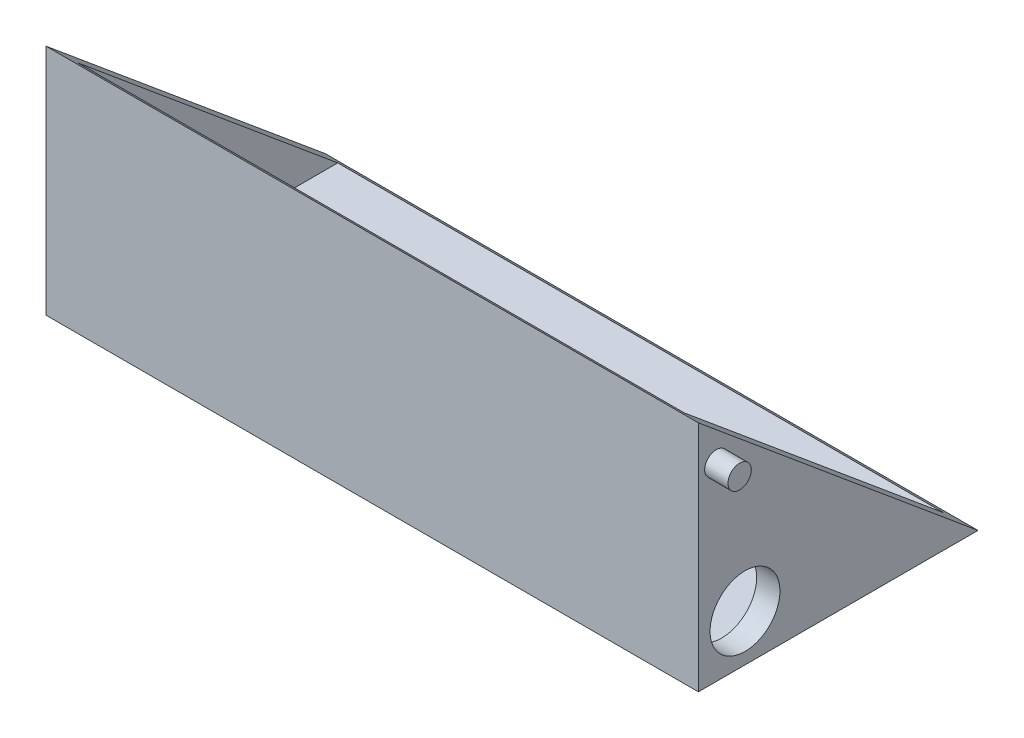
ISO-10303-21;
HEADER;
FILE_DESCRIPTION(('STEP AP214'),'2;1');
FILE_NAME('part.step','',(''),(''),'','','');
FILE_SCHEMA(('AUTOMOTIVE_DESIGN { 1 0 10303 214 1 1 1 1 }'));
ENDSEC;
DATA;
#1=APPLICATION_CONTEXT('core data for automotive mechanical design processes');
#2=APPLICATION_PROTOCOL_DEFINITION('international standard','automotive_design',2000,#1);
#3=PRODUCT_CONTEXT('',#1,'mechanical');
#4=PRODUCT('Part','Part','',(#3));
#5=PRODUCT_RELATED_PRODUCT_CATEGORY('part','',(#4));
#6=PRODUCT_DEFINITION_FORMATION('','',#4);
#7=PRODUCT_DEFINITION_CONTEXT('part definition',#1,'design');
#8=PRODUCT_DEFINITION('design','',#6,#7);
#9=PRODUCT_DEFINITION_SHAPE('','',#8);
#10=(LENGTH_UNIT() NAMED_UNIT(*) SI_UNIT(.MILLI.,.METRE.));
#11=(NAMED_UNIT(*) PLANE_ANGLE_UNIT() SI_UNIT($,.RADIAN.));
#12=(NAMED_UNIT(*) SI_UNIT($,.STERADIAN.) SOLID_ANGLE_UNIT());
#13=UNCERTAINTY_MEASURE_WITH_UNIT(LENGTH_MEASURE(1.E-05),#10,'distance_accuracy_value','');
#14=(GEOMETRIC_REPRESENTATION_CONTEXT(3) GLOBAL_UNCERTAINTY_ASSIGNED_CONTEXT((#13)) GLOBAL_UNIT_ASSIGNED_CONTEXT((#10,
#11,#12)) REPRESENTATION_CONTEXT('',''));
#15=CARTESIAN_POINT('',(0.,0.,0.));
#16=DIRECTION('',(0.,0.,1.));
#17=DIRECTION('',(1.,0.,0.));
#18=AXIS2_PLACEMENT_3D('',#15,#16,#17);
#19=CARTESIAN_POINT('',(-177.8,0.,-76.2));
#20=DIRECTION('',(0.,0.768221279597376,-0.64018439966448));
#21=DIRECTION('',(0.,0.64018439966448,0.768221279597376));
#22=AXIS2_PLACEMENT_3D('',#19,#20,#21);
#23=PLANE('',#22);
#24=DIRECTION('',(0.,0.64018439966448,0.768221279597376));
#25=VECTOR('',#24,1.);
#26=CARTESIAN_POINT('',(0.,0.,-76.2));
#27=LINE('',#26,#25);
#28=CARTESIAN_POINT('',(0.,0.,-76.2));
#29=VERTEX_POINT('',#28);
#30=CARTESIAN_POINT('',(0.,63.5,0.));
#31=VERTEX_POINT('',#30);
#32=EDGE_CURVE('E114',#29,#31,#27,.T.);
#33=ORIENTED_EDGE('',*,*,#32,.F.);
#34=DIRECTION('',(1.,0.,0.));
#35=VECTOR('',#34,1.);
#36=CARTESIAN_POINT('',(-177.8,0.,-76.2));
#37=LINE('',#36,#35);
#38=CARTESIAN_POINT('',(-177.8,0.,-76.2));
#39=VERTEX_POINT('',#38);
#40=EDGE_CURVE('E129',#39,#29,#37,.T.);
#41=ORIENTED_EDGE('',*,*,#40,.F.);
#42=DIRECTION('',(0.,0.64018439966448,0.768221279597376));
#43=VECTOR('',#42,1.);
#44=CARTESIAN_POINT('',(-177.8,0.,-76.2));
#45=LINE('',#44,#43);
#46=CARTESIAN_POINT('',(-177.8,63.5,0.));
#47=VERTEX_POINT('',#46);
#48=EDGE_CURVE('E117',#39,#47,#45,.T.);
#49=ORIENTED_EDGE('',*,*,#48,.T.);
#50=DIRECTION('',(1.,0.,0.));
#51=VECTOR('',#50,1.);
#52=CARTESIAN_POINT('',(-177.8,63.5,0.));
#53=LINE('',#52,#51);
#54=EDGE_CURVE('E58',#47,#31,#53,.T.);
#55=ORIENTED_EDGE('',*,*,#54,.T.);
#56=EDGE_LOOP('',(#33,#41,#49,#55));
#57=FACE_BOUND('',#56,.T.);
#58=DIRECTION('',(0.,0.64018439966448,0.768221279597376));
#59=VECTOR('',#58,1.);
#60=CARTESIAN_POINT('',(-6.34999999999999,0.,-76.2));
#61=LINE('',#60,#59);
#62=CARTESIAN_POINT('',(-6.34999999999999,2.54000000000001,-73.152));
#63=VERTEX_POINT('',#62);
#64=CARTESIAN_POINT('',(-6.35,61.3833333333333,-2.53999999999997));
#65=VERTEX_POINT('',#64);
#66=EDGE_CURVE('E94',#63,#65,#61,.T.);
#67=ORIENTED_EDGE('',*,*,#66,.T.);
#68=DIRECTION('',(-1.,0.,0.));
#69=VECTOR('',#68,1.);
#70=CARTESIAN_POINT('',(-177.8,61.3833333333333,-2.54));
#71=LINE('',#70,#69);
#72=CARTESIAN_POINT('',(-171.45,61.3833333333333,-2.54));
#73=VERTEX_POINT('',#72);
#74=EDGE_CURVE('E11',#65,#73,#71,.T.);
#75=ORIENTED_EDGE('',*,*,#74,.T.);
#76=DIRECTION('',(0.,-0.64018439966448,-0.768221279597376));
#77=VECTOR('',#76,1.);
#78=CARTESIAN_POINT('',(-171.45,0.,-76.2));
#79=LINE('',#78,#77);
#80=CARTESIAN_POINT('',(-171.45,2.54000000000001,-73.152));
#81=VERTEX_POINT('',#80);
#82=EDGE_CURVE('E42',#73,#81,#79,.T.);
#83=ORIENTED_EDGE('',*,*,#82,.T.);
#84=DIRECTION('',(-1.,0.,0.));
#85=VECTOR('',#84,1.);
#86=CARTESIAN_POINT('',(-177.8,2.54000000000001,-73.152));
#87=LINE('',#86,#85);
#88=EDGE_CURVE('E128',#63,#81,#87,.T.);
#89=ORIENTED_EDGE('',*,*,#88,.F.);
#90=EDGE_LOOP('',(#67,#75,#83,#89));
#91=FACE_BOUND('',#90,.T.);
#92=ADVANCED_FACE('F33',(#57,#91),#23,.T.);
#93=CARTESIAN_POINT('',(-177.8,0.,0.));
#94=DIRECTION('',(0.,-1.,0.));
#95=DIRECTION('',(0.,0.,-1.));
#96=AXIS2_PLACEMENT_3D('',#93,#94,#95);
#97=PLANE('',#96);
#98=DIRECTION('',(0.,0.,-1.));
#99=VECTOR('',#98,1.);
#100=CARTESIAN_POINT('',(0.,0.,0.));
#101=LINE('',#100,#99);
#102=CARTESIAN_POINT('',(0.,0.,0.));
#103=VERTEX_POINT('',#102);
#104=EDGE_CURVE('E122',#103,#29,#101,.T.);
#105=ORIENTED_EDGE('',*,*,#104,.F.);
#106=DIRECTION('',(1.,0.,0.));
#107=VECTOR('',#106,1.);
#108=CARTESIAN_POINT('',(-177.8,0.,0.));
#109=LINE('',#108,#107);
#110=CARTESIAN_POINT('',(-177.8,0.,0.));
#111=VERTEX_POINT('',#110);
#112=EDGE_CURVE('E120',#111,#103,#109,.T.);
#113=ORIENTED_EDGE('',*,*,#112,.F.);
#114=DIRECTION('',(0.,0.,-1.));
#115=VECTOR('',#114,1.);
#116=CARTESIAN_POINT('',(-177.8,0.,0.));
#117=LINE('',#116,#115);
#118=EDGE_CURVE('E113',#111,#39,#117,.T.);
#119=ORIENTED_EDGE('',*,*,#118,.T.);
#120=ORIENTED_EDGE('',*,*,#40,.T.);
#121=EDGE_LOOP('',(#105,#113,#119,#120));
#122=FACE_BOUND('',#121,.T.);
#123=ADVANCED_FACE('F178',(#122),#97,.T.);
#124=CARTESIAN_POINT('',(-177.8,22.975670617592,0.));
#125=DIRECTION('',(0.,0.,1.));
#126=DIRECTION('',(1.,0.,0.));
#127=AXIS2_PLACEMENT_3D('',#124,#125,#126);
#128=PLANE('',#127);
#129=DIRECTION('',(0.,-1.,0.));
#130=VECTOR('',#129,1.);
#131=CARTESIAN_POINT('',(0.,22.975670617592,0.));
#132=LINE('',#131,#130);
#133=EDGE_CURVE('E73',#31,#103,#132,.T.);
#134=ORIENTED_EDGE('',*,*,#133,.F.);
#135=ORIENTED_EDGE('',*,*,#54,.F.);
#136=DIRECTION('',(0.,-1.,0.));
#137=VECTOR('',#136,1.);
#138=CARTESIAN_POINT('',(-177.8,63.5,0.));
#139=LINE('',#138,#137);
#140=EDGE_CURVE('E74',#47,#111,#139,.T.);
#141=ORIENTED_EDGE('',*,*,#140,.T.);
#142=ORIENTED_EDGE('',*,*,#112,.T.);
#143=EDGE_LOOP('',(#134,#135,#141,#142));
#144=FACE_BOUND('',#143,.T.);
#145=ADVANCED_FACE('F35',(#144),#128,.T.);
#146=CARTESIAN_POINT('',(-177.8,0.,0.));
#147=DIRECTION('',(1.,0.,0.));
#148=DIRECTION('',(0.,0.,-1.));
#149=AXIS2_PLACEMENT_3D('',#146,#147,#148);
#150=PLANE('',#149);
#151=CARTESIAN_POINT('',(-177.8,12.7,-12.7));
#152=DIRECTION('',(1.,0.,0.));
#153=DIRECTION('',(0.,0.,-1.));
#154=AXIS2_PLACEMENT_3D('',#151,#152,#153);
#155=CIRCLE('',#154,9.52500000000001);
#156=CARTESIAN_POINT('',(-177.8,12.7,-22.225));
#157=VERTEX_POINT('',#156);
#158=EDGE_CURVE('E145',#157,#157,#155,.T.);
#159=ORIENTED_EDGE('',*,*,#158,.T.);
#160=EDGE_LOOP('',(#159));
#161=FACE_BOUND('',#160,.T.);
#162=ORIENTED_EDGE('',*,*,#140,.F.);
#163=ORIENTED_EDGE('',*,*,#48,.F.);
#164=ORIENTED_EDGE('',*,*,#118,.F.);
#165=EDGE_LOOP('',(#162,#163,#164));
#166=FACE_BOUND('',#165,.T.);
#167=ADVANCED_FACE('F167',(#161,#166),#150,.F.);
#168=CARTESIAN_POINT('',(0.,0.,0.));
#169=DIRECTION('',(1.,0.,0.));
#170=DIRECTION('',(0.,0.,-1.));
#171=AXIS2_PLACEMENT_3D('',#168,#169,#170);
#172=PLANE('',#171);
#173=CARTESIAN_POINT('',(0.,51.5471405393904,-4.89087816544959));
#174=DIRECTION('',(1.,0.,0.));
#175=DIRECTION('',(0.,0.,-1.));
#176=AXIS2_PLACEMENT_3D('',#173,#174,#175);
#177=CIRCLE('',#176,3.175);
#178=CARTESIAN_POINT('',(0.,51.5471405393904,-8.06587816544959));
#179=VERTEX_POINT('',#178);
#180=EDGE_CURVE('E149',#179,#179,#177,.T.);
#181=ORIENTED_EDGE('',*,*,#180,.F.);
#182=EDGE_LOOP('',(#181));
#183=FACE_BOUND('',#182,.T.);
#184=CARTESIAN_POINT('',(0.,12.7,-12.7));
#185=DIRECTION('',(1.,0.,0.));
#186=DIRECTION('',(0.,0.,-1.));
#187=AXIS2_PLACEMENT_3D('',#184,#185,#186);
#188=CIRCLE('',#187,9.52500000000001);
#189=CARTESIAN_POINT('',(0.,12.7,-22.225));
#190=VERTEX_POINT('',#189);
#191=EDGE_CURVE('E138',#190,#190,#188,.T.);
#192=ORIENTED_EDGE('',*,*,#191,.F.);
#193=EDGE_LOOP('',(#192));
#194=FACE_BOUND('',#193,.T.);
#195=ORIENTED_EDGE('',*,*,#32,.T.);
#196=ORIENTED_EDGE('',*,*,#133,.T.);
#197=ORIENTED_EDGE('',*,*,#104,.T.);
#198=EDGE_LOOP('',(#195,#196,#197));
#199=FACE_BOUND('',#198,.T.);
#200=ADVANCED_FACE('F164',(#183,#194,#199),#172,.T.);
#201=CARTESIAN_POINT('',(-171.45,2.54000000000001,-2.54));
#202=DIRECTION('',(1.,0.,0.));
#203=DIRECTION('',(0.,0.,-1.));
#204=AXIS2_PLACEMENT_3D('',#201,#202,#203);
#205=PLANE('',#204);
#206=CARTESIAN_POINT('',(-171.45,12.7,-12.7));
#207=DIRECTION('',(1.,0.,0.));
#208=DIRECTION('',(0.,0.,-1.));
#209=AXIS2_PLACEMENT_3D('',#206,#207,#208);
#210=CIRCLE('',#209,9.52500000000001);
#211=CARTESIAN_POINT('',(-171.45,12.7,-22.225));
#212=VERTEX_POINT('',#211);
#213=EDGE_CURVE('E140',#212,#212,#210,.T.);
#214=ORIENTED_EDGE('',*,*,#213,.F.);
#215=EDGE_LOOP('',(#214));
#216=FACE_BOUND('',#215,.T.);
#217=DIRECTION('',(0.,1.,0.));
#218=VECTOR('',#217,1.);
#219=CARTESIAN_POINT('',(-171.45,2.54000000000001,-2.54));
#220=LINE('',#219,#218);
#221=CARTESIAN_POINT('',(-171.45,2.54000000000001,-2.54));
#222=VERTEX_POINT('',#221);
#223=EDGE_CURVE('E103',#222,#73,#220,.T.);
#224=ORIENTED_EDGE('',*,*,#223,.F.);
#225=DIRECTION('',(0.,0.,-1.));
#226=VECTOR('',#225,1.);
#227=CARTESIAN_POINT('',(-171.45,2.54000000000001,-2.54));
#228=LINE('',#227,#226);
#229=EDGE_CURVE('E97',#222,#81,#228,.T.);
#230=ORIENTED_EDGE('',*,*,#229,.T.);
#231=ORIENTED_EDGE('',*,*,#82,.F.);
#232=EDGE_LOOP('',(#224,#230,#231));
#233=FACE_BOUND('',#232,.T.);
#234=ADVANCED_FACE('F137',(#216,#233),#205,.T.);
#235=CARTESIAN_POINT('',(-6.35,2.54000000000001,-2.53999999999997));
#236=DIRECTION('',(-1.,0.,0.));
#237=DIRECTION('',(0.,0.,1.));
#238=AXIS2_PLACEMENT_3D('',#235,#236,#237);
#239=PLANE('',#238);
#240=CARTESIAN_POINT('',(-6.34999999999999,12.7,-12.7));
#241=DIRECTION('',(-1.,0.,0.));
#242=DIRECTION('',(0.,0.,1.));
#243=AXIS2_PLACEMENT_3D('',#240,#241,#242);
#244=CIRCLE('',#243,9.52500000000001);
#245=CARTESIAN_POINT('',(-6.34999999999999,12.7,-3.17499999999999));
#246=VERTEX_POINT('',#245);
#247=EDGE_CURVE('E37',#246,#246,#244,.T.);
#248=ORIENTED_EDGE('',*,*,#247,.F.);
#249=EDGE_LOOP('',(#248));
#250=FACE_BOUND('',#249,.T.);
#251=DIRECTION('',(0.,0.,1.));
#252=VECTOR('',#251,1.);
#253=CARTESIAN_POINT('',(-6.35,2.54000000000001,-2.53999999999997));
#254=LINE('',#253,#252);
#255=CARTESIAN_POINT('',(-6.35,2.54000000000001,-2.53999999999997));
#256=VERTEX_POINT('',#255);
#257=EDGE_CURVE('E49',#63,#256,#254,.T.);
#258=ORIENTED_EDGE('',*,*,#257,.T.);
#259=DIRECTION('',(0.,1.,0.));
#260=VECTOR('',#259,1.);
#261=CARTESIAN_POINT('',(-6.35,2.54000000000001,-2.53999999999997));
#262=LINE('',#261,#260);
#263=EDGE_CURVE('E92',#256,#65,#262,.T.);
#264=ORIENTED_EDGE('',*,*,#263,.T.);
#265=ORIENTED_EDGE('',*,*,#66,.F.);
#266=EDGE_LOOP('',(#258,#264,#265));
#267=FACE_BOUND('',#266,.T.);
#268=ADVANCED_FACE('F91',(#250,#267),#239,.T.);
#269=CARTESIAN_POINT('',(-171.45,2.54000000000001,-2.54));
#270=DIRECTION('',(0.,0.,-1.));
#271=DIRECTION('',(-1.,0.,0.));
#272=AXIS2_PLACEMENT_3D('',#269,#270,#271);
#273=PLANE('',#272);
#274=ORIENTED_EDGE('',*,*,#263,.F.);
#275=DIRECTION('',(-1.,0.,0.));
#276=VECTOR('',#275,1.);
#277=CARTESIAN_POINT('',(-171.45,2.54000000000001,-2.54));
#278=LINE('',#277,#276);
#279=EDGE_CURVE('E96',#256,#222,#278,.T.);
#280=ORIENTED_EDGE('',*,*,#279,.T.);
#281=ORIENTED_EDGE('',*,*,#223,.T.);
#282=ORIENTED_EDGE('',*,*,#74,.F.);
#283=EDGE_LOOP('',(#274,#280,#281,#282));
#284=FACE_BOUND('',#283,.T.);
#285=ADVANCED_FACE('F100',(#284),#273,.T.);
#286=CARTESIAN_POINT('',(0.,2.54000000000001,0.));
#287=DIRECTION('',(0.,-1.,0.));
#288=DIRECTION('',(0.,0.,-1.));
#289=AXIS2_PLACEMENT_3D('',#286,#287,#288);
#290=PLANE('',#289);
#291=ORIENTED_EDGE('',*,*,#88,.T.);
#292=ORIENTED_EDGE('',*,*,#229,.F.);
#293=ORIENTED_EDGE('',*,*,#279,.F.);
#294=ORIENTED_EDGE('',*,*,#257,.F.);
#295=EDGE_LOOP('',(#291,#292,#293,#294));
#296=FACE_BOUND('',#295,.T.);
#297=ADVANCED_FACE('F106',(#296),#290,.F.);
#298=CARTESIAN_POINT('',(-177.8,12.7,-12.7));
#299=DIRECTION('',(1.,0.,0.));
#300=DIRECTION('',(0.,0.,-1.));
#301=AXIS2_PLACEMENT_3D('',#298,#299,#300);
#302=CYLINDRICAL_SURFACE('',#301,9.52500000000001);
#303=ORIENTED_EDGE('',*,*,#191,.T.);
#304=EDGE_LOOP('',(#303));
#305=FACE_BOUND('',#304,.T.);
#306=ORIENTED_EDGE('',*,*,#247,.T.);
#307=EDGE_LOOP('',(#306));
#308=FACE_BOUND('',#307,.T.);
#309=ADVANCED_FACE('F201',(#305,#308),#302,.F.);
#310=ORIENTED_EDGE('',*,*,#213,.T.);
#311=EDGE_LOOP('',(#310));
#312=FACE_BOUND('',#311,.T.);
#313=ORIENTED_EDGE('',*,*,#158,.F.);
#314=EDGE_LOOP('',(#313));
#315=FACE_BOUND('',#314,.T.);
#316=ADVANCED_FACE('F160',(#312,#315),#302,.F.);
#317=CARTESIAN_POINT('',(6.35,51.5471405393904,-4.89087816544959));
#318=DIRECTION('',(-1.,0.,0.));
#319=DIRECTION('',(0.,0.,1.));
#320=AXIS2_PLACEMENT_3D('',#317,#318,#319);
#321=CYLINDRICAL_SURFACE('',#320,3.175);
#322=CARTESIAN_POINT('',(6.35,51.5471405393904,-4.89087816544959));
#323=DIRECTION('',(1.,0.,0.));
#324=DIRECTION('',(0.,0.,-1.));
#325=AXIS2_PLACEMENT_3D('',#322,#323,#324);
#326=CIRCLE('',#325,3.175);
#327=CARTESIAN_POINT('',(6.35,51.5471405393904,-8.06587816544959));
#328=VERTEX_POINT('',#327);
#329=EDGE_CURVE('E148',#328,#328,#326,.T.);
#330=ORIENTED_EDGE('',*,*,#329,.F.);
#331=EDGE_LOOP('',(#330));
#332=FACE_BOUND('',#331,.T.);
#333=ORIENTED_EDGE('',*,*,#180,.T.);
#334=EDGE_LOOP('',(#333));
#335=FACE_BOUND('',#334,.T.);
#336=ADVANCED_FACE('F157',(#332,#335),#321,.T.);
#337=CARTESIAN_POINT('',(6.35,51.5471405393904,-4.89087816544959));
#338=DIRECTION('',(1.,0.,0.));
#339=DIRECTION('',(0.,0.,-1.));
#340=AXIS2_PLACEMENT_3D('',#337,#338,#339);
#341=PLANE('',#340);
#342=ORIENTED_EDGE('',*,*,#329,.T.);
#343=EDGE_LOOP('',(#342));
#344=FACE_BOUND('',#343,.T.);
#345=ADVANCED_FACE('F155',(#344),#341,.T.);
#346=CLOSED_SHELL('',(#92,#123,#145,#167,#200,#234,#268,#285,#297,#309,#316,#336,#345));
#347=MANIFOLD_SOLID_BREP('B2',#346);
#348=ADVANCED_BREP_SHAPE_REPRESENTATION('',(#18,#347),#14);
#349=SHAPE_DEFINITION_REPRESENTATION(#9,#348);
ENDSEC;
END-ISO-10303-21;
